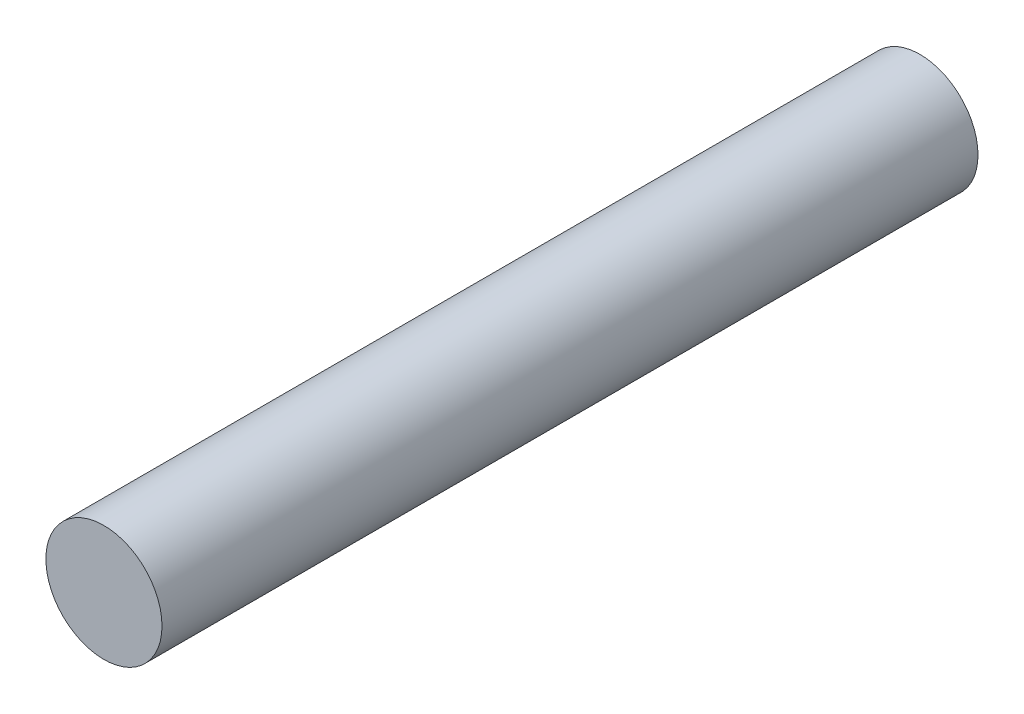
from build123d import *

# Parameters (mm, degrees)
ESQUISSE1_R      = 35
EXTRUSION1_DEPTH = 246


with BuildPart() as part:
    # Esquisse1 → Extrusion1 (new, symmetric)
    with BuildSketch(Plane.XY):
        Circle(ESQUISSE1_R)
    extrude(amount=EXTRUSION1_DEPTH, both=True)


solid = part.part
